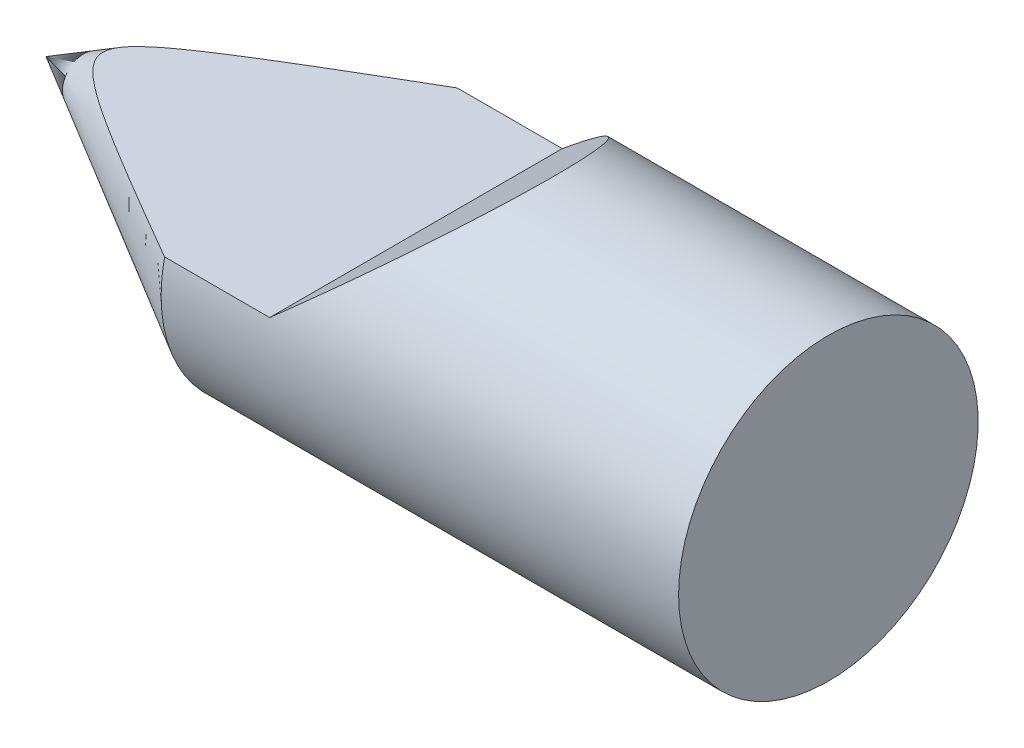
ISO-10303-21;
HEADER;
FILE_DESCRIPTION(('STEP AP214'),'2;1');
FILE_NAME('part.step','',(''),(''),'','','');
FILE_SCHEMA(('AUTOMOTIVE_DESIGN { 1 0 10303 214 1 1 1 1 }'));
ENDSEC;
DATA;
#1=APPLICATION_CONTEXT('core data for automotive mechanical design processes');
#2=APPLICATION_PROTOCOL_DEFINITION('international standard','automotive_design',2000,#1);
#3=PRODUCT_CONTEXT('',#1,'mechanical');
#4=PRODUCT('Part','Part','',(#3));
#5=PRODUCT_RELATED_PRODUCT_CATEGORY('part','',(#4));
#6=PRODUCT_DEFINITION_FORMATION('','',#4);
#7=PRODUCT_DEFINITION_CONTEXT('part definition',#1,'design');
#8=PRODUCT_DEFINITION('design','',#6,#7);
#9=PRODUCT_DEFINITION_SHAPE('','',#8);
#10=(LENGTH_UNIT() NAMED_UNIT(*) SI_UNIT(.MILLI.,.METRE.));
#11=(NAMED_UNIT(*) PLANE_ANGLE_UNIT() SI_UNIT($,.RADIAN.));
#12=(NAMED_UNIT(*) SI_UNIT($,.STERADIAN.) SOLID_ANGLE_UNIT());
#13=UNCERTAINTY_MEASURE_WITH_UNIT(LENGTH_MEASURE(1.E-05),#10,'distance_accuracy_value','');
#14=(GEOMETRIC_REPRESENTATION_CONTEXT(3) GLOBAL_UNCERTAINTY_ASSIGNED_CONTEXT((#13)) GLOBAL_UNIT_ASSIGNED_CONTEXT((#10,
#11,#12)) REPRESENTATION_CONTEXT('',''));
#15=CARTESIAN_POINT('',(0.,0.,0.));
#16=DIRECTION('',(0.,0.,1.));
#17=DIRECTION('',(1.,0.,0.));
#18=AXIS2_PLACEMENT_3D('',#15,#16,#17);
#19=CARTESIAN_POINT('',(29.1431690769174,17.9669188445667,0.));
#20=DIRECTION('',(-1.,0.,0.));
#21=DIRECTION('',(0.,0.,1.));
#22=AXIS2_PLACEMENT_3D('',#19,#20,#21);
#23=PLANE('',#22);
#24=CARTESIAN_POINT('',(29.1431690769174,0.,0.));
#25=DIRECTION('',(-1.,0.,0.));
#26=DIRECTION('',(0.,0.,1.));
#27=AXIS2_PLACEMENT_3D('',#24,#25,#26);
#28=CIRCLE('',#27,17.9669188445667);
#29=CARTESIAN_POINT('',(29.1431690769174,0.,17.9669188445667));
#30=VERTEX_POINT('',#29);
#31=EDGE_CURVE('E75',#30,#30,#28,.T.);
#32=ORIENTED_EDGE('',*,*,#31,.F.);
#33=EDGE_LOOP('',(#32));
#34=FACE_BOUND('',#33,.T.);
#35=ADVANCED_FACE('F31',(#34),#23,.F.);
#36=CARTESIAN_POINT('',(-78.064396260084,0.,0.));
#37=DIRECTION('',(-1.,0.,0.));
#38=DIRECTION('',(0.,0.,1.));
#39=AXIS2_PLACEMENT_3D('',#36,#37,#38);
#40=CYLINDRICAL_SURFACE('',#39,17.9669188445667);
#41=CARTESIAN_POINT('',(-24.8226419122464,0.,0.));
#42=DIRECTION('',(0.650470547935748,-0.759531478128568,0.));
#43=DIRECTION('',(-0.759531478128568,-0.650470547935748,0.));
#44=AXIS2_PLACEMENT_3D('',#41,#42,#43);
#45=ELLIPSE('',#44,27.6214179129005,17.9669188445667);
#46=CARTESIAN_POINT('',(-20.3261701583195,3.85082452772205,-17.5493966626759));
#47=VERTEX_POINT('',#46);
#48=CARTESIAN_POINT('',(-20.3261701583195,3.85082452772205,17.5493966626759));
#49=VERTEX_POINT('',#48);
#50=EDGE_CURVE('E11',#47,#49,#45,.T.);
#51=ORIENTED_EDGE('',*,*,#50,.T.);
#52=DIRECTION('',(-1.,0.,0.));
#53=VECTOR('',#52,1.);
#54=CARTESIAN_POINT('',(-78.064396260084,3.85082452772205,17.5493966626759));
#55=LINE('',#54,#53);
#56=CARTESIAN_POINT('',(-32.9243687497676,3.85082452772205,17.5493966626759));
#57=VERTEX_POINT('',#56);
#58=EDGE_CURVE('E64',#49,#57,#55,.T.);
#59=ORIENTED_EDGE('',*,*,#58,.T.);
#60=CARTESIAN_POINT('',(-32.9243687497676,0.,0.));
#61=DIRECTION('',(-1.,0.,0.));
#62=DIRECTION('',(0.,0.,1.));
#63=AXIS2_PLACEMENT_3D('',#60,#61,#62);
#64=CIRCLE('',#63,17.9669188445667);
#65=CARTESIAN_POINT('',(-32.9243687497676,3.85082452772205,-17.5493966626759));
#66=VERTEX_POINT('',#65);
#67=EDGE_CURVE('E70',#66,#57,#64,.T.);
#68=ORIENTED_EDGE('',*,*,#67,.F.);
#69=DIRECTION('',(-1.,0.,0.));
#70=VECTOR('',#69,1.);
#71=CARTESIAN_POINT('',(-78.064396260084,3.85082452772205,-17.5493966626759));
#72=LINE('',#71,#70);
#73=EDGE_CURVE('E45',#66,#47,#72,.F.);
#74=ORIENTED_EDGE('',*,*,#73,.T.);
#75=EDGE_LOOP('',(#51,#59,#68,#74));
#76=FACE_BOUND('',#75,.T.);
#77=ORIENTED_EDGE('',*,*,#31,.T.);
#78=EDGE_LOOP('',(#77));
#79=FACE_BOUND('',#78,.T.);
#80=ADVANCED_FACE('F67',(#76,#79),#40,.T.);
#81=CARTESIAN_POINT('',(-32.9243687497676,0.,0.));
#82=DIRECTION('',(1.,0.,0.));
#83=DIRECTION('',(0.,0.,-1.));
#84=AXIS2_PLACEMENT_3D('',#81,#82,#83);
#85=CONICAL_SURFACE('',#84,17.9669188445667,0.514605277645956);
#86=CARTESIAN_POINT('',(-64.7005723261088,0.,0.));
#87=VERTEX_POINT('',#86);
#88=VERTEX_LOOP('',#87);
#89=FACE_BOUND('',#88,.T.);
#90=ORIENTED_EDGE('',*,*,#67,.T.);
#91=CARTESIAN_POINT('',(42.3380629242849,3.85082452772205,-60.3992126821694));
#92=CARTESIAN_POINT('',(39.5232104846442,3.85082452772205,-58.8043954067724));
#93=CARTESIAN_POINT('',(36.7084592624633,3.85082452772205,-57.2093994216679));
#94=CARTESIAN_POINT('',(31.0792017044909,3.85082452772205,-54.0188863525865));
#95=CARTESIAN_POINT('',(28.2646953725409,3.85082452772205,-52.423369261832));
#96=CARTESIAN_POINT('',(22.6258315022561,3.85082452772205,-49.2259012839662));
#97=CARTESIAN_POINT('',(19.8014752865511,3.85082452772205,-47.6239480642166));
#98=CARTESIAN_POINT('',(14.1532954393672,3.85082452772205,-44.4191920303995));
#99=CARTESIAN_POINT('',(11.3294718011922,3.85082452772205,-42.8163892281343));
#100=CARTESIAN_POINT('',(5.4404801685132,3.85082452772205,-39.472129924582));
#101=CARTESIAN_POINT('',(2.37537352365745,3.85082452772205,-37.7305653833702));
#102=CARTESIAN_POINT('',(-3.75376752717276,3.85082452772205,-34.2452519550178));
#103=CARTESIAN_POINT('',(-6.81780188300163,3.85082452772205,-32.5015029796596));
#104=CARTESIAN_POINT('',(-11.4066780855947,3.85082452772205,-29.8865897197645));
#105=CARTESIAN_POINT('',(-12.9322483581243,3.85082452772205,-29.016703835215));
#106=CARTESIAN_POINT('',(-15.9827541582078,3.85082452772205,-27.2758199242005));
#107=CARTESIAN_POINT('',(-17.5076896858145,3.85082452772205,-26.4048218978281));
#108=CARTESIAN_POINT('',(-20.5564821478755,3.85082452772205,-24.6614774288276));
#109=CARTESIAN_POINT('',(-22.0803392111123,3.85082452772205,-23.789131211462));
#110=CARTESIAN_POINT('',(-25.1268854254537,3.85082452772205,-22.042403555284));
#111=CARTESIAN_POINT('',(-26.6495745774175,3.85082452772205,-21.1680221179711));
#112=CARTESIAN_POINT('',(-29.4125128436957,3.85082452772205,-19.577918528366));
#113=CARTESIAN_POINT('',(-30.6530433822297,3.85082452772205,-18.8626855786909));
#114=CARTESIAN_POINT('',(-33.1330818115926,3.85082452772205,-17.4291953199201));
#115=CARTESIAN_POINT('',(-34.3725890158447,3.85082452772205,-16.7109368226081));
#116=CARTESIAN_POINT('',(-36.8612447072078,3.85082452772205,-15.263592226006));
#117=CARTESIAN_POINT('',(-38.1103713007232,3.85082452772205,-14.5344684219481));
#118=CARTESIAN_POINT('',(-39.9804534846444,3.85082452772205,-13.4366867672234));
#119=CARTESIAN_POINT('',(-40.602766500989,3.85082452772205,-13.0703419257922));
#120=CARTESIAN_POINT('',(-41.8461940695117,3.85082452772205,-12.3356924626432));
#121=CARTESIAN_POINT('',(-42.4673086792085,3.85082452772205,-11.9673879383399));
#122=CARTESIAN_POINT('',(-43.6877202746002,3.85082452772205,-11.240300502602));
#123=CARTESIAN_POINT('',(-44.2870664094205,3.85082452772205,-10.8816001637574));
#124=CARTESIAN_POINT('',(-45.4839535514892,3.85082452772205,-10.1609532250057));
#125=CARTESIAN_POINT('',(-46.0814942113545,3.85082452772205,-9.79900604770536));
#126=CARTESIAN_POINT('',(-47.2772113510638,3.85082452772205,-9.06879172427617));
#127=CARTESIAN_POINT('',(-47.8753733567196,3.85082452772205,-8.70050080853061));
#128=CARTESIAN_POINT('',(-48.769511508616,3.85082452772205,-8.14350654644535));
#129=CARTESIAN_POINT('',(-49.0669448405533,3.85082452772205,-7.95714286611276));
#130=CARTESIAN_POINT('',(-49.660609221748,3.85082452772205,-7.58251151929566));
#131=CARTESIAN_POINT('',(-49.9568402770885,3.85082452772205,-7.39424386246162));
#132=CARTESIAN_POINT('',(-50.5422176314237,3.85082452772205,-7.01894961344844));
#133=CARTESIAN_POINT('',(-50.8313919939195,3.85082452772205,-6.83196684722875));
#134=CARTESIAN_POINT('',(-51.407904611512,3.85082452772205,-6.45519580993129));
#135=CARTESIAN_POINT('',(-51.6952428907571,3.85082452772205,-6.26540757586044));
#136=CARTESIAN_POINT('',(-52.2682676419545,3.85082452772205,-5.8817805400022));
#137=CARTESIAN_POINT('',(-52.5539480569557,3.85082452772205,-5.68793266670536));
#138=CARTESIAN_POINT('',(-53.1220518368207,3.85082452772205,-5.29561713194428));
#139=CARTESIAN_POINT('',(-53.4044757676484,3.85082452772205,-5.09715029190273));
#140=CARTESIAN_POINT('',(-53.9620075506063,3.85082452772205,-4.69609019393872));
#141=CARTESIAN_POINT('',(-54.2371608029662,3.85082452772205,-4.49356053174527));
#142=CARTESIAN_POINT('',(-54.6452226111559,3.85082452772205,-4.18339679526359));
#143=CARTESIAN_POINT('',(-54.7805182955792,3.85082452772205,-4.07890434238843));
#144=CARTESIAN_POINT('',(-55.0491255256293,3.85082452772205,-3.86740375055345));
#145=CARTESIAN_POINT('',(-55.1824371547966,3.85082452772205,-3.76039571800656));
#146=CARTESIAN_POINT('',(-55.4460260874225,3.85082452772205,-3.54380609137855));
#147=CARTESIAN_POINT('',(-55.5763137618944,3.85082452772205,-3.43423715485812));
#148=CARTESIAN_POINT('',(-55.8337239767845,3.85082452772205,-3.21145375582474));
#149=CARTESIAN_POINT('',(-55.9608468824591,3.85082452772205,-3.09823971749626));
#150=CARTESIAN_POINT('',(-56.210794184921,3.85082452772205,-2.86745562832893));
#151=CARTESIAN_POINT('',(-56.3336237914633,3.85082452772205,-2.74989124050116));
#152=CARTESIAN_POINT('',(-56.5736826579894,3.85082452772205,-2.50920022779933));
#153=CARTESIAN_POINT('',(-56.6909143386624,3.85082452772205,-2.38607605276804));
#154=CARTESIAN_POINT('',(-56.825348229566,3.85082452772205,-2.23586879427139));
#155=CARTESIAN_POINT('',(-56.846331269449,3.85082452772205,-2.21215066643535));
#156=CARTESIAN_POINT('',(-56.8880074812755,3.85082452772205,-2.16445603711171));
#157=CARTESIAN_POINT('',(-56.9087006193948,3.85082452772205,-2.140479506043));
#158=CARTESIAN_POINT('',(-56.9703206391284,3.85082452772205,-2.06814109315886));
#159=CARTESIAN_POINT('',(-57.0107801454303,3.85082452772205,-2.01937928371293));
#160=CARTESIAN_POINT('',(-57.0902823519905,3.85082452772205,-1.92068094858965));
#161=CARTESIAN_POINT('',(-57.1293245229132,3.85082452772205,-1.87074399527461));
#162=CARTESIAN_POINT('',(-57.2057509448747,3.85082452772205,-1.76962138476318));
#163=CARTESIAN_POINT('',(-57.2431352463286,3.85082452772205,-1.71843576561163));
#164=CARTESIAN_POINT('',(-57.3518229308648,3.85082452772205,-1.56372001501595));
#165=CARTESIAN_POINT('',(-57.4203419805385,3.85082452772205,-1.45819868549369));
#166=CARTESIAN_POINT('',(-57.5472656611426,3.85082452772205,-1.24121352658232));
#167=CARTESIAN_POINT('',(-57.6056781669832,3.85082452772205,-1.1297544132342));
#168=CARTESIAN_POINT('',(-57.6851998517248,3.85082452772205,-0.953375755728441));
#169=CARTESIAN_POINT('',(-57.7111135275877,3.85082452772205,-0.890615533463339));
#170=CARTESIAN_POINT('',(-57.7583578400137,3.85082452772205,-0.763391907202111));
#171=CARTESIAN_POINT('',(-57.7796895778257,3.85082452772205,-0.69892891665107));
#172=CARTESIAN_POINT('',(-57.8171609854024,3.85082452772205,-0.568447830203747));
#173=CARTESIAN_POINT('',(-57.8332968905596,3.85082452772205,-0.502428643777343));
#174=CARTESIAN_POINT('',(-57.8597861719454,3.85082452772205,-0.369242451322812));
#175=CARTESIAN_POINT('',(-57.8701407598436,3.85082452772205,-0.3020756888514));
#176=CARTESIAN_POINT('',(-57.8847119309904,3.85082452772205,-0.166563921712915));
#177=CARTESIAN_POINT('',(-57.888882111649,3.85082452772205,-0.0982138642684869));
#178=CARTESIAN_POINT('',(-57.8907557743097,3.85082452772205,0.0385710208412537));
#179=CARTESIAN_POINT('',(-57.8884596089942,3.85082452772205,0.107005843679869));
#180=CARTESIAN_POINT('',(-57.8775007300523,3.85082452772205,0.243341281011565));
#181=CARTESIAN_POINT('',(-57.8688399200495,3.85082452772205,0.311242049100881));
#182=CARTESIAN_POINT('',(-57.8455221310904,3.85082452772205,0.446020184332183));
#183=CARTESIAN_POINT('',(-57.8308615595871,3.85082452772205,0.512896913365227));
#184=CARTESIAN_POINT('',(-57.7704369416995,3.85082452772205,0.742552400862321));
#185=CARTESIAN_POINT('',(-57.7106342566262,3.85082452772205,0.901764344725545));
#186=CARTESIAN_POINT('',(-57.6031452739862,3.85082452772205,1.13187141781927));
#187=CARTESIAN_POINT('',(-57.5642639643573,3.85082452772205,1.20725180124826));
#188=CARTESIAN_POINT('',(-57.4815914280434,3.85082452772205,1.35529569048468));
#189=CARTESIAN_POINT('',(-57.437800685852,3.85082452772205,1.42795946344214));
#190=CARTESIAN_POINT('',(-57.3319416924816,3.85082452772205,1.59294171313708));
#191=CARTESIAN_POINT('',(-57.2684311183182,3.85082452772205,1.68432619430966));
#192=CARTESIAN_POINT('',(-57.1360878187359,3.85082452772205,1.86318490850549));
#193=CARTESIAN_POINT('',(-57.0672525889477,3.85082452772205,1.95065727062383));
#194=CARTESIAN_POINT('',(-56.9253302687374,3.85082452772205,2.1223122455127));
#195=CARTESIAN_POINT('',(-56.8522360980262,3.85082452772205,2.20648896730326));
#196=CARTESIAN_POINT('',(-56.7027650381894,3.85082452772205,2.37187967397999));
#197=CARTESIAN_POINT('',(-56.6263877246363,3.85082452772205,2.45309327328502));
#198=CARTESIAN_POINT('',(-56.4704522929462,3.85082452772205,2.61353025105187));
#199=CARTESIAN_POINT('',(-56.3908753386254,3.85082452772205,2.69273525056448));
#200=CARTESIAN_POINT('',(-56.2295558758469,3.85082452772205,2.8489061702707));
#201=CARTESIAN_POINT('',(-56.1478132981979,3.85082452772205,2.92587201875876));
#202=CARTESIAN_POINT('',(-55.98264395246,3.85082452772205,3.07777413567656));
#203=CARTESIAN_POINT('',(-55.8992192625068,3.85082452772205,3.15271266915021));
#204=CARTESIAN_POINT('',(-55.7308900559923,3.85082452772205,3.30089806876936));
#205=CARTESIAN_POINT('',(-55.6459855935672,3.85082452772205,3.37414499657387));
#206=CARTESIAN_POINT('',(-55.370258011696,3.85082452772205,3.60792102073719));
#207=CARTESIAN_POINT('',(-55.1769804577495,3.85082452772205,3.76555737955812));
#208=CARTESIAN_POINT('',(-54.7860762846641,3.85082452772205,4.07535894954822));
#209=CARTESIAN_POINT('',(-54.5884489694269,3.85082452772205,4.22752327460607));
#210=CARTESIAN_POINT('',(-54.1898918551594,3.85082452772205,4.52765796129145));
#211=CARTESIAN_POINT('',(-53.9889604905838,3.85082452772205,4.67562623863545));
#212=CARTESIAN_POINT('',(-53.5846484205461,3.85082452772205,4.96818453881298));
#213=CARTESIAN_POINT('',(-53.3812676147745,3.85082452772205,5.11277442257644));
#214=CARTESIAN_POINT('',(-52.9721925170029,3.85082452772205,5.39950910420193));
#215=CARTESIAN_POINT('',(-52.7664944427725,3.85082452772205,5.5416484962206));
#216=CARTESIAN_POINT('',(-52.3535634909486,3.85082452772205,5.82368245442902));
#217=CARTESIAN_POINT('',(-52.1463305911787,3.85082452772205,5.96357698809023));
#218=CARTESIAN_POINT('',(-51.5229069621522,3.85082452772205,6.38040043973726));
#219=CARTESIAN_POINT('',(-51.1048636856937,3.85082452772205,6.6545578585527));
#220=CARTESIAN_POINT('',(-50.2662838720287,3.85082452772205,7.19705058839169));
#221=CARTESIAN_POINT('',(-49.8457544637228,3.85082452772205,7.46539697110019));
#222=CARTESIAN_POINT('',(-49.0022184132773,3.85082452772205,7.9982298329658));
#223=CARTESIAN_POINT('',(-48.5792115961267,3.85082452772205,8.26271603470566));
#224=CARTESIAN_POINT('',(-47.7318795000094,3.85082452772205,8.78841566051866));
#225=CARTESIAN_POINT('',(-47.3075564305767,3.85082452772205,9.04963265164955));
#226=CARTESIAN_POINT('',(-46.4575134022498,3.85082452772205,9.56975749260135));
#227=CARTESIAN_POINT('',(-46.03179347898,3.85082452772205,9.82866540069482));
#228=CARTESIAN_POINT('',(-45.1794604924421,3.85082452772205,10.3445182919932));
#229=CARTESIAN_POINT('',(-44.7528479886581,3.85082452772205,10.6014642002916));
#230=CARTESIAN_POINT('',(-43.8987317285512,3.85082452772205,11.1138709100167));
#231=CARTESIAN_POINT('',(-43.4712279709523,3.85082452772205,11.369331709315));
#232=CARTESIAN_POINT('',(-42.1876301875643,3.85082452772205,12.1339016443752));
#233=CARTESIAN_POINT('',(-41.330454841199,3.85082452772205,12.6411951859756));
#234=CARTESIAN_POINT('',(-39.6140936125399,3.85082452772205,13.6524257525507));
#235=CARTESIAN_POINT('',(-38.7549076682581,3.85082452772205,14.1563626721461));
#236=CARTESIAN_POINT('',(-37.0350942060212,3.85082452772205,15.1617719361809));
#237=CARTESIAN_POINT('',(-36.1744666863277,3.85082452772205,15.663244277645));
#238=CARTESIAN_POINT('',(-34.4515933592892,3.85082452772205,16.6646546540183));
#239=CARTESIAN_POINT('',(-33.5893468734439,3.85082452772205,17.1645915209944));
#240=CARTESIAN_POINT('',(-31.8640250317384,3.85082452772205,18.163034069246));
#241=CARTESIAN_POINT('',(-31.0009496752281,3.85082452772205,18.6615397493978));
#242=CARTESIAN_POINT('',(-28.4107898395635,3.85082452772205,20.1553684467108));
#243=CARTESIAN_POINT('',(-26.6827417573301,3.85082452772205,21.1490204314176));
#244=CARTESIAN_POINT('',(-23.2441140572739,3.85082452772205,23.1224645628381));
#245=CARTESIAN_POINT('',(-21.5335526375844,3.85082452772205,24.102288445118));
#246=CARTESIAN_POINT('',(-18.1112958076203,3.85082452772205,26.059975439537));
#247=CARTESIAN_POINT('',(-16.3996003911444,3.85082452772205,27.0378385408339));
#248=CARTESIAN_POINT('',(-12.9766675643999,3.85082452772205,28.9914352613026));
#249=CARTESIAN_POINT('',(-11.2654307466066,3.85082452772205,29.9671699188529));
#250=CARTESIAN_POINT('',(-7.84235738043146,3.85082452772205,31.9175620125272));
#251=CARTESIAN_POINT('',(-6.13052083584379,3.85082452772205,32.8922194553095));
#252=CARTESIAN_POINT('',(-4.41847535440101,3.85082452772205,33.8665092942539));
#253=B_SPLINE_CURVE_WITH_KNOTS('',3,(#91,#92,#93,#94,#95,#96,#97,#98,#99,#100,#101,#102,#103,
#104,#105,#106,#107,#108,#109,#110,#111,#112,#113,#114,#115,#116,#117,#118,#119,#120,#121,#122,
#123,#124,#125,#126,#127,#128,#129,#130,#131,#132,#133,#134,#135,#136,#137,#138,#139,#140,#141,
#142,#143,#144,#145,#146,#147,#148,#149,#150,#151,#152,#153,#154,#155,#156,#157,#158,#159,#160,
#161,#162,#163,#164,#165,#166,#167,#168,#169,#170,#171,#172,#173,#174,#175,#176,#177,#178,#179,
#180,#181,#182,#183,#184,#185,#186,#187,#188,#189,#190,#191,#192,#193,#194,#195,#196,#197,#198,
#199,#200,#201,#202,#203,#204,#205,#206,#207,#208,#209,#210,#211,#212,#213,#214,#215,#216,#217,
#218,#219,#220,#221,#222,#223,#224,#225,#226,#227,#228,#229,#230,#231,#232,#233,#234,#235,#236,
#237,#238,#239,#240,#241,#242,#243,#244,#245,#246,#247,#248,#249,#250,#251,#252),.UNSPECIFIED.,
.F.,.F.,(4,2,2,2,2,2,2,2,2,2,2,2,2,2,2,2,2,2,2,2,2,2,2,2,2,2,2,2,2,2,2,2,2,2,2,2,2,2,2,2,2,2,2,
2,2,2,2,2,2,2,2,2,2,2,2,2,2,2,2,2,2,2,2,2,2,2,2,2,2,2,2,2,2,2,2,2,2,2,2,2,4),(0.,
9.70574718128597,19.4116260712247,29.1527336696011,38.8937093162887,49.4696879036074,
60.0461083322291,65.314560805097,70.5830128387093,75.8506634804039,81.11831024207,
85.4141507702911,89.7118742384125,94.0509216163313,96.2173303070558,98.383632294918,
100.479080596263,102.574909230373,104.682228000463,105.735209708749,106.788186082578,
107.821255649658,108.854311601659,109.889994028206,110.92549365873,111.950322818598,
112.463147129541,112.975949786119,113.486604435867,113.997199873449,114.507152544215,
115.016882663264,115.111883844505,115.206896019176,115.396956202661,115.587086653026,
115.777211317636,116.154241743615,116.530977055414,116.734530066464,116.938034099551,
117.141685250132,117.345293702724,117.550422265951,117.755539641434,117.960595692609,
118.165774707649,118.672625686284,118.92698323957,119.181315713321,119.514929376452,
119.848700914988,120.183044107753,120.517430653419,120.854207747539,121.190995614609,
121.527390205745,121.863772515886,122.611847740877,123.360043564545,124.108604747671,
124.85719669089,125.607270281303,126.357354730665,127.857057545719,129.353593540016,
130.850236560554,132.345071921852,133.839869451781,135.333912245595,136.827957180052,
139.816065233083,142.804266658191,145.792471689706,148.782562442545,151.77265554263,
157.75273825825,163.666675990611,169.580646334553,175.490257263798,181.399831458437),.UNSPECIFIED.);
#254=EDGE_CURVE('E38',#57,#66,#253,.F.);
#255=ORIENTED_EDGE('',*,*,#254,.T.);
#256=EDGE_LOOP('',(#90,#255));
#257=FACE_BOUND('',#256,.T.);
#258=ADVANCED_FACE('F84',(#89,#257),#85,.T.);
#259=CARTESIAN_POINT('',(2.77877700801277,23.6381382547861,-17.9669188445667));
#260=DIRECTION('',(0.650470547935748,-0.759531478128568,0.));
#261=DIRECTION('',(0.759531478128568,0.650470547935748,0.));
#262=AXIS2_PLACEMENT_3D('',#259,#260,#261);
#263=PLANE('',#262);
#264=DIRECTION('',(0.,0.,1.));
#265=VECTOR('',#264,1.);
#266=CARTESIAN_POINT('',(-20.3261701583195,3.85082452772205,-17.9669188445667));
#267=LINE('',#266,#265);
#268=EDGE_CURVE('E60',#47,#49,#267,.T.);
#269=ORIENTED_EDGE('',*,*,#268,.T.);
#270=ORIENTED_EDGE('',*,*,#50,.F.);
#271=EDGE_LOOP('',(#269,#270));
#272=FACE_BOUND('',#271,.T.);
#273=ADVANCED_FACE('F59',(#272),#263,.F.);
#274=CARTESIAN_POINT('',(-20.3261701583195,3.85082452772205,-17.9669188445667));
#275=DIRECTION('',(0.,-1.,0.));
#276=DIRECTION('',(0.,0.,-1.));
#277=AXIS2_PLACEMENT_3D('',#274,#275,#276);
#278=PLANE('',#277);
#279=ORIENTED_EDGE('',*,*,#268,.F.);
#280=ORIENTED_EDGE('',*,*,#73,.F.);
#281=ORIENTED_EDGE('',*,*,#254,.F.);
#282=ORIENTED_EDGE('',*,*,#58,.F.);
#283=EDGE_LOOP('',(#279,#280,#281,#282));
#284=FACE_BOUND('',#283,.T.);
#285=ADVANCED_FACE('F63',(#284),#278,.F.);
#286=CLOSED_SHELL('',(#35,#80,#258,#273,#285));
#287=MANIFOLD_SOLID_BREP('B2',#286);
#288=ADVANCED_BREP_SHAPE_REPRESENTATION('',(#18,#287),#14);
#289=SHAPE_DEFINITION_REPRESENTATION(#9,#288);
ENDSEC;
END-ISO-10303-21;
